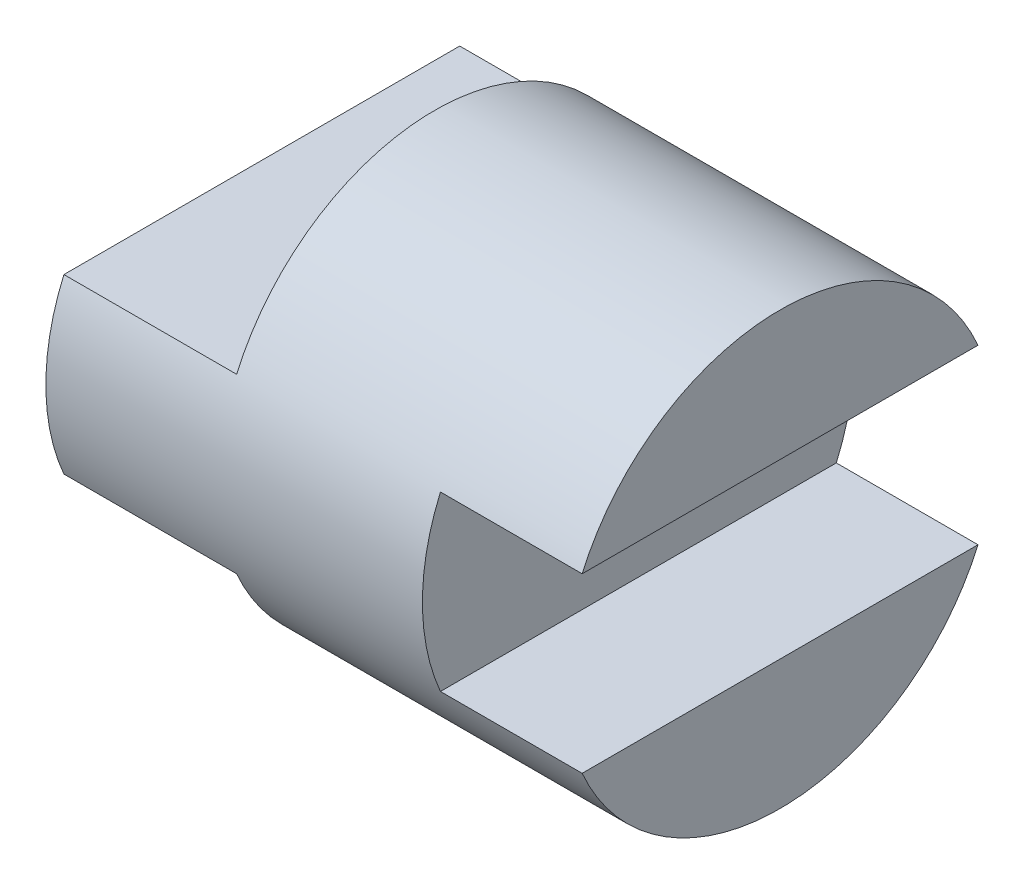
from build123d import *

# Parameters (mm, degrees)
SKETCH_2_R          = 50
EXTRUDE_1_DEPTH     = 120
SKETCH_3_W          = 111.148674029
SKETCH_3_H          = 32.848771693
CUT_EXTRUDE_1_DEPTH = 40
SKETCH_4_W          = 73.521062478
SKETCH_4_H          = 40
CUT_EXTRUDE_2_DEPTH = 50


with BuildPart() as part:
    # Sketch 2 → Extrude 1 (new body)
    with BuildSketch(Plane(origin=(0, 0, 0), x_dir=(0, 0, -1), z_dir=(1, 0, 0))):
        Circle(SKETCH_2_R)
    extrude(amount=EXTRUDE_1_DEPTH)

    # Sketch 3 → Cut-Extrude 1 (cut)
    with BuildSketch(Plane.ZY):
        with Locations((-2.685748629, -36.424385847)):
            Rectangle(SKETCH_3_W, SKETCH_3_H)
        with Locations((-2.685748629, 36.424385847)):
            Rectangle(SKETCH_3_W, SKETCH_3_H)
    extrude(amount=-CUT_EXTRUDE_1_DEPTH, mode=Mode.SUBTRACT)

    # Sketch 4 → Cut-Extrude 2 (cut, symmetric)
    with BuildSketch(Plane.XY):
        with Locations((123.95140661, 0)):
            Rectangle(SKETCH_4_W, SKETCH_4_H)
    extrude(amount=CUT_EXTRUDE_2_DEPTH, both=True, mode=Mode.SUBTRACT)


solid = part.part
